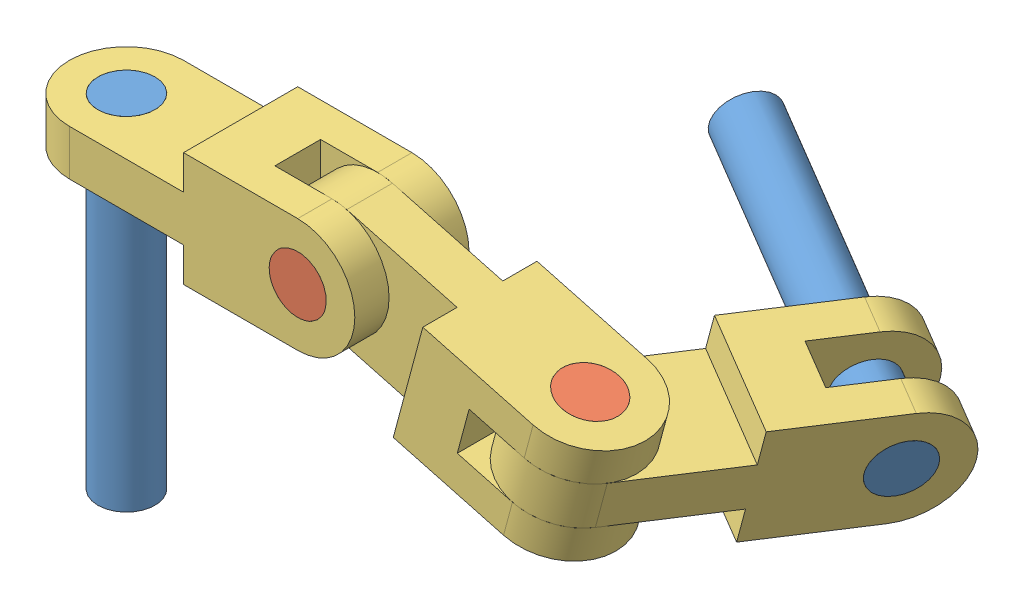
SolidWorks assembly CSW_tut_02_final.SLDASM, configuration Default (file format 13000). Lengths in mm.
Overall size (601.95 341.24 381.11).
7 component instances, 3 part files, 14 mates.
Components (placement in the parent):
- 2.13.1-1: 2.13.1.SLDPRT [Default] at origin size (50 300 50)
- 2.13.3-1: 2.13.3.SLDPRT [Default] at (200 -20 50) x (0.869739 -0.493513 0) z (-0.493513 -0.869739 0) size (50 100 50)
- 2.13.2-1: 2.13.2.SLDPRT [Default] at (100 -20 0) x (0 -1 0) z (0 0 1) size (100 300 100)
- 2.13.3-2: 2.13.3.SLDPRT [Default] at (406.1261 -23.4675 0) x (-0.081056 0.021719 0.996473) z (-0.962519 0.257906 -0.083915) size (50 100 50)
- 2.13.2-2: 2.13.2.SLDPRT [Default] at (434.007 -82.702 -90.6308) x (-0.258819 -0.965926 0) z (0.875426 -0.23457 0.422618) size (100 300 100)
- 2.13.2-3: 2.13.2.SLDPRT [Default] at (296.5926 -45.8819 0) x (0 0 -1) z (-0.258819 -0.965926 0) size (100 300 100)
- 2.13.1-2: 2.13.1.SLDPRT [Default] at (255.9722 -34.9977 -286.9161) x (0.461296 0.144345 -0.875426) z (0.144345 0.961323 0.23457) size (50 300 50)
Mates (geometry in assembly coordinates):
- Concentric1: concentric anti-aligned: cylinder of 2.13.1-1 through (0 -300 0) axis (0 1 0) radius 25; cylinder of 2.13.2-1 through (0 30 0) axis (0 -1 0) radius 25
- Coincident1: coincident aligned: plane of 2.13.1-1 through (0 0 0) normal (0 1 0); plane of 2.13.2-1 through (0 0 0) normal (0 1 0)
- Concentric2: concentric anti-aligned: cylinder of 2.13.2-1 through (200 -20 -50) axis (0 0 1) radius 25; cylinder of 2.13.2-3 through (200 -20 50) axis (0 0 -1) radius 25
- Coincident2: coincident anti-aligned: plane of 2.13.2-1 through (250 30 20) normal (0 0 -1); plane of 2.13.2-3 through (200 -20 20) normal (0 0 1)
- Concentric3: concentric aligned: cylinder of 2.13.2-2 through (406.1261 -23.4675 0) axis (-0.258819 -0.965926 0) radius 25; cylinder of 2.13.2-3 through (406.1261 -23.4675 0) axis (-0.258819 -0.965926 0) radius 25
- Coincident3: coincident anti-aligned: plane of 2.13.2-2 through (388.0088 -91.0823 0) normal (-0.258819 -0.965926 0); plane of 2.13.2-3 through (436.3051 -104.0233 50) normal (0.258819 0.965926 0)
- Concentric4: concentric aligned: cylinder of 2.13.3-1 through (200 -20 -50) axis (0 0 1) radius 25; cylinder of 2.13.2-1 through (200 -20 -50) axis (0 0 1) radius 25
- Coincident4: coincident aligned: plane of 2.13.3-1 through (200 -20 50) normal (0 0 1); plane of 2.13.2-1 through (200 -20 50) normal (0 0 1)
- Concentric5: concentric anti-aligned: cylinder of 2.13.3-2 through (380.2442 -120.0601 0) axis (0.258819 0.965926 0) radius 25; cylinder of 2.13.2-3 through (406.1261 -23.4675 0) axis (-0.258819 -0.965926 0) radius 25
- Coincident5: coincident aligned: plane of 2.13.3-2 through (380.2442 -120.0601 0) normal (-0.258819 -0.965926 0); plane of 2.13.2-3 through (380.2442 -120.0601 0) normal (-0.258819 -0.965926 0)
- Concentric7: concentric anti-aligned: cylinder of 2.13.2-2 through (586.3703 -123.5276 -50) axis (0 0 1) radius 25; cylinder of 2.13.1-2 through (586.3703 -123.5276 50) axis (0 0 -1) radius 25
- Coincident6: coincident aligned: plane of 2.13.2-2; plane of 2.13.1-2
- Angle1: planar angle = 2.879793 rad anti-aligned: plane of 2.13.2-1 through (100 30 50) normal (0 1 0); plane of 2.13.2-3 through (406.1261 -23.4675 0) normal (0.258819 0.965926 0)
- Angle3: planar angle = 2.007129 rad anti-aligned: plane of 2.13.2-3 through (283.6516 -94.1782 -50) normal (0 0 -1); plane of 2.13.2-2 through (431.0574 -81.9117 -202.3925) normal (-0.875426 0.23457 -0.422618)
